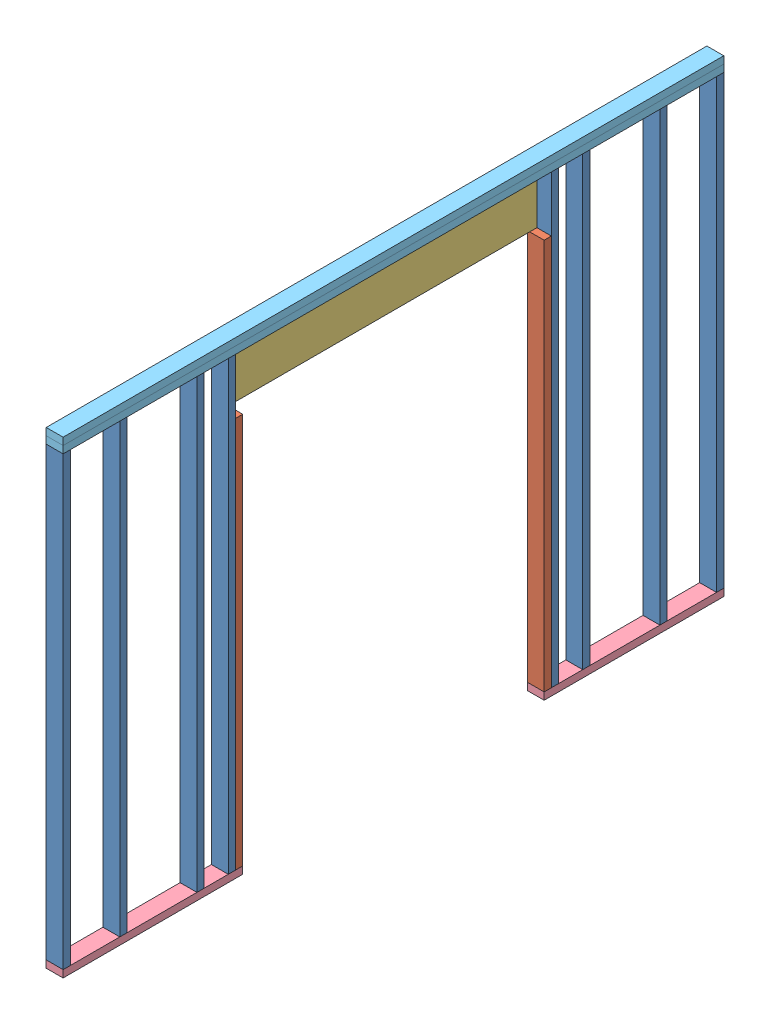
SolidWorks assembly DESN220-51C-MKrueger-front wall with doorway.SLDASM, configuration Default (file format 6000). Lengths in mm.
Overall size (88.9 2466.97 3479.8).
15 component instances, 5 part files, 22 mates.
Components (placement in the parent):
- DESN220-51C-MKrueger-2x4 STUD-1: DESN220-51C-MKrueger-2x4 STUD.SLDPRT [Default] at (-12.7 2403.475 177.8) x (1 0 0) z (0 -1 0) size (88.9 38.1 2352.68)
- DESN220-51C-MKrueger-2x4x81-125-1: DESN220-51C-MKrueger-2x4x81-125.SLDPRT [Default] at (-12.7 50.8 2749.55) x (1 0 0) z (0 1 0) size (88.9 38.1 2060.57)
- DESN220-51C-MKrueger-2x4x81-125-2: DESN220-51C-MKrueger-2x4x81-125.SLDPRT [Default] at (-12.7 2111.375 1085.85) x (1 0 0) z (0 -1 0) size (88.9 38.1 2060.57)
- DESN220-51C-MKrueger-2x4 STUD-7: DESN220-51C-MKrueger-2x4 STUD.SLDPRT [Default] at (-12.7 2403.475 3619.5) x (1 0 0) z (0 -1 0) size (88.9 38.1 2352.68)
- DESN220-51C-MKrueger-2x12x65-500-1: DESN220-51C-MKrueger-2x12x65-500.SLDPRT [Default] at (-88.9 2257.425 1917.7) x (0 0 -1) z (0 1 0) size (1663.7 12.7 292.1)
- DESN220-51C-MKrueger-2x4 STUD-16: DESN220-51C-MKrueger-2x4 STUD.SLDPRT [Default] at (-12.7 2403.475 1047.75) x (1 0 0) z (0 -1 0) size (88.9 38.1 2352.68)
- DESN220-51C-MKrueger-2x4 STUD-18: DESN220-51C-MKrueger-2x4 STUD.SLDPRT [Default] at (-12.7 2403.475 2749.55) x (1 0 0) z (0 -1 0) size (88.9 38.1 2352.68)
- DESN220-51C-MKrueger-2x4x37-250-1: DESN220-51C-MKrueger-2x4x37-250.SLDPRT [Default] at (-57.15 12.7 3184.525) size (88.9 38.1 946.15)
- DESN220-51C-MKrueger-2x4x37-250-2: DESN220-51C-MKrueger-2x4x37-250.SLDPRT [Default] at (-57.15 12.7 650.875) size (88.9 38.1 946.15)
- DESN220-51C-MKrueger-2x4x137-1: DESN220-51C-MKrueger-2x4x137.SLDPRT [Default] at (-12.7 2403.475 177.8) size (88.9 38.1 3479.8)
- DESN220-51C-MKrueger-2x4x137-2: DESN220-51C-MKrueger-2x4x137.SLDPRT [Default] at (-12.7 2441.575 177.8) size (88.9 38.1 3479.8)
- DESN220-51C-MKrueger-2x4 STUD-19: DESN220-51C-MKrueger-2x4 STUD.SLDPRT [Default] at (-12.7 2403.475 476.25) x (1 0 0) z (0 -1 0) size (88.9 38.1 2352.68)
- DESN220-51C-MKrueger-2x4 STUD-20: DESN220-51C-MKrueger-2x4 STUD.SLDPRT [Default] at (-12.7 2403.475 882.65) x (1 0 0) z (0 -1 0) size (88.9 38.1 2352.68)
- DESN220-51C-MKrueger-2x4 STUD-21: DESN220-51C-MKrueger-2x4 STUD.SLDPRT [Default] at (-12.7 2403.475 2914.65) x (1 0 0) z (0 -1 0) size (88.9 38.1 2352.68)
- DESN220-51C-MKrueger-2x4 STUD-22: DESN220-51C-MKrueger-2x4 STUD.SLDPRT [Default] at (-12.7 2403.475 3321.05) x (1 0 0) z (0 -1 0) size (88.9 38.1 2352.68)
Mates (geometry in assembly coordinates):
- Coincident88: coincident anti-aligned: plane of DESN220-51C-MKrueger-2x4x81-125-1 through (-12.7 2111.375 2711.45) normal (0 1 0); plane of DESN220-51C-MKrueger-2x12x65-500-1 through (-101.6 2111.375 2749.55) normal (0 -1 0)
- Coincident89: coincident anti-aligned: plane of DESN220-51C-MKrueger-2x4x81-125-2 through (-101.6 2111.375 1123.95) normal (0 1 0); plane of DESN220-51C-MKrueger-2x12x65-500-1 through (-101.6 2111.375 2749.55) normal (0 -1 0)
- Coincident101: coincident anti-aligned: plane of DESN220-51C-MKrueger-2x12x65-500-1 through (-101.6 2403.475 2749.55) normal (0 0 1); plane of DESN220-51C-MKrueger-2x4 STUD-18 through (-12.7 2403.475 2749.55) normal (0 0 -1)
- Coincident104: coincident anti-aligned: plane of DESN220-51C-MKrueger-2x12x65-500-1 through (-101.6 2403.475 1085.85) normal (0 0 -1); plane of DESN220-51C-MKrueger-2x4 STUD-16 through (-12.7 2403.475 1085.85) normal (0 0 1)
- Coincident105: coincident anti-aligned: plane of DESN220-51C-MKrueger-2x4x81-125-1 through (-12.7 50.8 2749.55) normal (0 0 1); plane of DESN220-51C-MKrueger-2x4 STUD-18 through (-12.7 2403.475 2749.55) normal (0 0 -1)
- Coincident106: coincident anti-aligned: plane of DESN220-51C-MKrueger-2x4x81-125-2 through (-12.7 2111.375 1085.85) normal (0 0 -1); plane of DESN220-51C-MKrueger-2x4 STUD-16 through (-12.7 2403.475 1085.85) normal (0 0 1)
- Coincident107: coincident aligned: plane of DESN220-51C-MKrueger-2x4 STUD-7 through (-12.7 2403.475 3657.6) normal (0 0 1); plane of DESN220-51C-MKrueger-2x4x37-250-1 through (-101.6 50.8 3657.6) normal (0 0 1)
- Coincident108: coincident aligned: plane of DESN220-51C-MKrueger-2x4 STUD-7 through (-101.6 50.8 3657.6) normal (-1 0 0); plane of DESN220-51C-MKrueger-2x4x37-250-1 through (-101.6 50.8 3657.6) normal (-1 0 0)
- Coincident109: coincident anti-aligned: plane of DESN220-51C-MKrueger-2x4 STUD-7 through (-12.7 50.8 3657.6) normal (0 -1 0); plane of DESN220-51C-MKrueger-2x4x37-250-1 through (-57.15 50.8 3184.525) normal (0 1 0)
- Coincident110: coincident aligned: plane of DESN220-51C-MKrueger-2x4 STUD-7 through (-12.7 2403.475 3657.6) normal (0 0 1); plane of DESN220-51C-MKrueger-2x4x137-1 through (-12.7 2441.575 3657.6) normal (0 0 1)
- Coincident111: coincident aligned: plane of DESN220-51C-MKrueger-2x4 STUD-7 through (-12.7 2403.475 3657.6) normal (1 0 0); plane of DESN220-51C-MKrueger-2x4x137-1 through (-12.7 2441.575 177.8) normal (1 0 0)
- Coincident112: coincident anti-aligned: plane of DESN220-51C-MKrueger-2x4 STUD-7 through (-101.6 2403.475 3657.6) normal (0 1 0); plane of DESN220-51C-MKrueger-2x4x137-1 through (-12.7 2403.475 177.8) normal (0 -1 0)
- Coincident113: coincident aligned: plane of DESN220-51C-MKrueger-2x4x137-1 through (-12.7 2441.575 3657.6) normal (0 0 1); plane of DESN220-51C-MKrueger-2x4x137-2 through (-12.7 2479.675 3657.6) normal (0 0 1)
- Coincident114: coincident aligned: plane of DESN220-51C-MKrueger-2x4x137-1 through (-12.7 2441.575 177.8) normal (1 0 0); plane of DESN220-51C-MKrueger-2x4x137-2 through (-12.7 2479.675 177.8) normal (1 0 0)
- Coincident115: coincident anti-aligned: plane of DESN220-51C-MKrueger-2x4x137-1 through (-12.7 2441.575 177.8) normal (0 1 0); plane of DESN220-51C-MKrueger-2x4x137-2 through (-12.7 2441.575 177.8) normal (0 -1 0)
- Coincident116: coincident aligned: plane of DESN220-51C-MKrueger-2x4 STUD-1 through (-12.7 2403.475 177.8) normal (0 0 -1); plane of DESN220-51C-MKrueger-2x4x137-1 through (-101.6 2441.575 177.8) normal (0 0 -1)
- Coincident117: coincident aligned: plane of DESN220-51C-MKrueger-2x4 STUD-1 through (-12.7 2403.475 215.9) normal (1 0 0); plane of DESN220-51C-MKrueger-2x4x137-1 through (-12.7 2441.575 177.8) normal (1 0 0)
- Coincident118: coincident aligned: plane of DESN220-51C-MKrueger-2x4 STUD-1 through (-101.6 50.8 215.9) normal (-1 0 0); plane of DESN220-51C-MKrueger-2x4x137-1 through (-101.6 2441.575 3657.6) normal (-1 0 0)
- Coincident119: coincident aligned: plane of DESN220-51C-MKrueger-2x4x81-125-1 through (-12.7 50.8 2711.45) normal (0 0 -1); plane of DESN220-51C-MKrueger-2x4x37-250-1 through (-101.6 50.8 2711.45) normal (0 0 -1)
- Coincident120: coincident aligned: plane of DESN220-51C-MKrueger-2x4x81-125-2 through (-12.7 2111.375 1123.95) normal (0 0 1); plane of DESN220-51C-MKrueger-2x4x37-250-2 through (-101.6 50.8 1123.95) normal (0 0 1)
- Coincident121: coincident anti-aligned: plane of DESN220-51C-MKrueger-2x4x81-125-2 through (-12.7 50.8 1123.95) normal (0 -1 0); plane of DESN220-51C-MKrueger-2x4x37-250-2 through (-57.15 50.8 650.875) normal (0 1 0)
- Coincident122: coincident aligned: plane of DESN220-51C-MKrueger-2x4x81-125-2 through (-12.7 2111.375 1123.95) normal (1 0 0); plane of DESN220-51C-MKrueger-2x4x37-250-2 through (-12.7 50.8 1123.95) normal (1 0 0)
